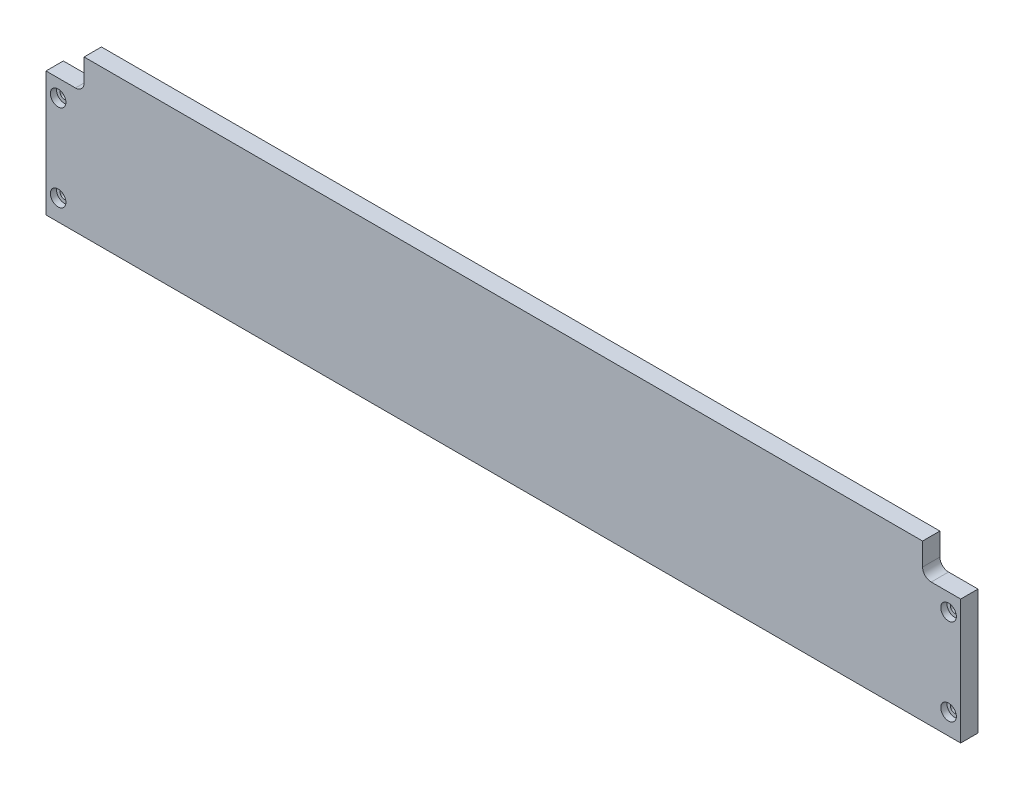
ISO-10303-21;
HEADER;
FILE_DESCRIPTION(('STEP AP214'),'2;1');
FILE_NAME('part.step','',(''),(''),'','','');
FILE_SCHEMA(('AUTOMOTIVE_DESIGN { 1 0 10303 214 1 1 1 1 }'));
ENDSEC;
DATA;
#1=APPLICATION_CONTEXT('core data for automotive mechanical design processes');
#2=APPLICATION_PROTOCOL_DEFINITION('international standard','automotive_design',2000,#1);
#3=PRODUCT_CONTEXT('',#1,'mechanical');
#4=PRODUCT('Part','Part','',(#3));
#5=PRODUCT_RELATED_PRODUCT_CATEGORY('part','',(#4));
#6=PRODUCT_DEFINITION_FORMATION('','',#4);
#7=PRODUCT_DEFINITION_CONTEXT('part definition',#1,'design');
#8=PRODUCT_DEFINITION('design','',#6,#7);
#9=PRODUCT_DEFINITION_SHAPE('','',#8);
#10=(LENGTH_UNIT() NAMED_UNIT(*) SI_UNIT(.MILLI.,.METRE.));
#11=(NAMED_UNIT(*) PLANE_ANGLE_UNIT() SI_UNIT($,.RADIAN.));
#12=(NAMED_UNIT(*) SI_UNIT($,.STERADIAN.) SOLID_ANGLE_UNIT());
#13=UNCERTAINTY_MEASURE_WITH_UNIT(LENGTH_MEASURE(1.E-05),#10,'distance_accuracy_value','');
#14=(GEOMETRIC_REPRESENTATION_CONTEXT(3) GLOBAL_UNCERTAINTY_ASSIGNED_CONTEXT((#13)) GLOBAL_UNIT_ASSIGNED_CONTEXT((#10,
#11,#12)) REPRESENTATION_CONTEXT('',''));
#15=CARTESIAN_POINT('',(0.,0.,0.));
#16=DIRECTION('',(0.,0.,1.));
#17=DIRECTION('',(1.,0.,0.));
#18=AXIS2_PLACEMENT_3D('',#15,#16,#17);
#19=CARTESIAN_POINT('',(-335.28,0.,6.35));
#20=DIRECTION('',(1.,0.,0.));
#21=DIRECTION('',(0.,0.,-1.));
#22=AXIS2_PLACEMENT_3D('',#19,#20,#21);
#23=PLANE('',#22);
#24=DIRECTION('',(0.,-1.,0.));
#25=VECTOR('',#24,1.);
#26=CARTESIAN_POINT('',(-335.28,0.,-6.35));
#27=LINE('',#26,#25);
#28=CARTESIAN_POINT('',(-335.28,91.44,-6.35));
#29=VERTEX_POINT('',#28);
#30=CARTESIAN_POINT('',(-335.28,0.,-6.35));
#31=VERTEX_POINT('',#30);
#32=EDGE_CURVE('E142',#29,#31,#27,.T.);
#33=ORIENTED_EDGE('',*,*,#32,.T.);
#34=DIRECTION('',(0.,0.,-1.));
#35=VECTOR('',#34,1.);
#36=CARTESIAN_POINT('',(-335.28,0.,6.35));
#37=LINE('',#36,#35);
#38=CARTESIAN_POINT('',(-335.28,0.,6.35));
#39=VERTEX_POINT('',#38);
#40=EDGE_CURVE('E11',#39,#31,#37,.T.);
#41=ORIENTED_EDGE('',*,*,#40,.F.);
#42=DIRECTION('',(0.,-1.,0.));
#43=VECTOR('',#42,1.);
#44=CARTESIAN_POINT('',(-335.28,0.,6.35));
#45=LINE('',#44,#43);
#46=CARTESIAN_POINT('',(-335.28,91.44,6.35));
#47=VERTEX_POINT('',#46);
#48=EDGE_CURVE('E161',#47,#39,#45,.T.);
#49=ORIENTED_EDGE('',*,*,#48,.F.);
#50=DIRECTION('',(0.,0.,-1.));
#51=VECTOR('',#50,1.);
#52=CARTESIAN_POINT('',(-335.28,91.44,6.35));
#53=LINE('',#52,#51);
#54=EDGE_CURVE('E138',#47,#29,#53,.T.);
#55=ORIENTED_EDGE('',*,*,#54,.T.);
#56=EDGE_LOOP('',(#33,#41,#49,#55));
#57=FACE_BOUND('',#56,.T.);
#58=ADVANCED_FACE('F34',(#57),#23,.F.);
#59=CARTESIAN_POINT('',(335.28,2.4980018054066E-13,6.35));
#60=DIRECTION('',(0.,1.,0.));
#61=DIRECTION('',(-1.,0.,0.));
#62=AXIS2_PLACEMENT_3D('',#59,#60,#61);
#63=PLANE('',#62);
#64=DIRECTION('',(1.,0.,0.));
#65=VECTOR('',#64,1.);
#66=CARTESIAN_POINT('',(335.28,2.4980018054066E-13,-6.35));
#67=LINE('',#66,#65);
#68=CARTESIAN_POINT('',(335.28,2.4980018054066E-13,-6.35));
#69=VERTEX_POINT('',#68);
#70=EDGE_CURVE('E145',#31,#69,#67,.T.);
#71=ORIENTED_EDGE('',*,*,#70,.T.);
#72=DIRECTION('',(0.,0.,-1.));
#73=VECTOR('',#72,1.);
#74=CARTESIAN_POINT('',(335.28,2.4980018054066E-13,6.35));
#75=LINE('',#74,#73);
#76=CARTESIAN_POINT('',(335.28,2.4980018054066E-13,6.35));
#77=VERTEX_POINT('',#76);
#78=EDGE_CURVE('E42',#77,#69,#75,.T.);
#79=ORIENTED_EDGE('',*,*,#78,.F.);
#80=DIRECTION('',(1.,0.,0.));
#81=VECTOR('',#80,1.);
#82=CARTESIAN_POINT('',(335.28,2.4980018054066E-13,6.35));
#83=LINE('',#82,#81);
#84=EDGE_CURVE('E99',#39,#77,#83,.T.);
#85=ORIENTED_EDGE('',*,*,#84,.F.);
#86=ORIENTED_EDGE('',*,*,#40,.T.);
#87=EDGE_LOOP('',(#71,#79,#85,#86));
#88=FACE_BOUND('',#87,.T.);
#89=ADVANCED_FACE('F292',(#88),#63,.F.);
#90=CARTESIAN_POINT('',(335.28,2.4980018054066E-13,6.35));
#91=DIRECTION('',(-1.,0.,0.));
#92=DIRECTION('',(0.,0.,1.));
#93=AXIS2_PLACEMENT_3D('',#90,#91,#92);
#94=PLANE('',#93);
#95=DIRECTION('',(0.,1.,0.));
#96=VECTOR('',#95,1.);
#97=CARTESIAN_POINT('',(335.28,2.4980018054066E-13,-6.35));
#98=LINE('',#97,#96);
#99=CARTESIAN_POINT('',(335.28,91.44,-6.35));
#100=VERTEX_POINT('',#99);
#101=EDGE_CURVE('E148',#69,#100,#98,.T.);
#102=ORIENTED_EDGE('',*,*,#101,.T.);
#103=DIRECTION('',(0.,0.,-1.));
#104=VECTOR('',#103,1.);
#105=CARTESIAN_POINT('',(335.28,91.44,6.35));
#106=LINE('',#105,#104);
#107=CARTESIAN_POINT('',(335.28,91.44,6.35));
#108=VERTEX_POINT('',#107);
#109=EDGE_CURVE('E174',#108,#100,#106,.T.);
#110=ORIENTED_EDGE('',*,*,#109,.F.);
#111=DIRECTION('',(0.,1.,0.));
#112=VECTOR('',#111,1.);
#113=CARTESIAN_POINT('',(335.28,2.4980018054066E-13,6.35));
#114=LINE('',#113,#112);
#115=EDGE_CURVE('E182',#77,#108,#114,.T.);
#116=ORIENTED_EDGE('',*,*,#115,.F.);
#117=ORIENTED_EDGE('',*,*,#78,.T.);
#118=EDGE_LOOP('',(#102,#110,#116,#117));
#119=FACE_BOUND('',#118,.T.);
#120=ADVANCED_FACE('F180',(#119),#94,.F.);
#121=CARTESIAN_POINT('',(335.28,91.44,6.35));
#122=DIRECTION('',(0.,-1.,0.));
#123=DIRECTION('',(1.,0.,0.));
#124=AXIS2_PLACEMENT_3D('',#121,#122,#123);
#125=PLANE('',#124);
#126=DIRECTION('',(-1.,0.,0.));
#127=VECTOR('',#126,1.);
#128=CARTESIAN_POINT('',(335.28,91.44,-6.35));
#129=LINE('',#128,#127);
#130=CARTESIAN_POINT('',(313.69,91.4399999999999,-6.35));
#131=VERTEX_POINT('',#130);
#132=EDGE_CURVE('E150',#100,#131,#129,.T.);
#133=ORIENTED_EDGE('',*,*,#132,.T.);
#134=DIRECTION('',(0.,0.,-1.));
#135=VECTOR('',#134,1.);
#136=CARTESIAN_POINT('',(313.69,91.4399999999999,6.35));
#137=LINE('',#136,#135);
#138=CARTESIAN_POINT('',(313.69,91.4399999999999,6.35));
#139=VERTEX_POINT('',#138);
#140=EDGE_CURVE('E171',#139,#131,#137,.T.);
#141=ORIENTED_EDGE('',*,*,#140,.F.);
#142=DIRECTION('',(-1.,0.,0.));
#143=VECTOR('',#142,1.);
#144=CARTESIAN_POINT('',(335.28,91.44,6.35));
#145=LINE('',#144,#143);
#146=EDGE_CURVE('E200',#108,#139,#145,.T.);
#147=ORIENTED_EDGE('',*,*,#146,.F.);
#148=ORIENTED_EDGE('',*,*,#109,.T.);
#149=EDGE_LOOP('',(#133,#141,#147,#148));
#150=FACE_BOUND('',#149,.T.);
#151=ADVANCED_FACE('F191',(#150),#125,.F.);
#152=CARTESIAN_POINT('',(313.69,97.7899999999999,6.35));
#153=DIRECTION('',(0.,0.,-1.));
#154=DIRECTION('',(-1.,0.,0.));
#155=AXIS2_PLACEMENT_3D('',#152,#153,#154);
#156=CYLINDRICAL_SURFACE('',#155,6.35000000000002);
#157=CARTESIAN_POINT('',(313.69,97.7899999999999,-6.35));
#158=DIRECTION('',(0.,0.,-1.));
#159=DIRECTION('',(-1.,0.,0.));
#160=AXIS2_PLACEMENT_3D('',#157,#158,#159);
#161=CIRCLE('',#160,6.35000000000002);
#162=CARTESIAN_POINT('',(307.34,97.7899999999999,-6.35));
#163=VERTEX_POINT('',#162);
#164=EDGE_CURVE('E152',#131,#163,#161,.T.);
#165=ORIENTED_EDGE('',*,*,#164,.T.);
#166=DIRECTION('',(0.,0.,-1.));
#167=VECTOR('',#166,1.);
#168=CARTESIAN_POINT('',(307.34,97.7899999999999,6.35));
#169=LINE('',#168,#167);
#170=CARTESIAN_POINT('',(307.34,97.7899999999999,6.35));
#171=VERTEX_POINT('',#170);
#172=EDGE_CURVE('E168',#171,#163,#169,.T.);
#173=ORIENTED_EDGE('',*,*,#172,.F.);
#174=CARTESIAN_POINT('',(313.69,97.7899999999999,6.35));
#175=DIRECTION('',(0.,0.,-1.));
#176=DIRECTION('',(-1.,0.,0.));
#177=AXIS2_PLACEMENT_3D('',#174,#175,#176);
#178=CIRCLE('',#177,6.35000000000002);
#179=EDGE_CURVE('E197',#139,#171,#178,.T.);
#180=ORIENTED_EDGE('',*,*,#179,.F.);
#181=ORIENTED_EDGE('',*,*,#140,.T.);
#182=EDGE_LOOP('',(#165,#173,#180,#181));
#183=FACE_BOUND('',#182,.T.);
#184=ADVANCED_FACE('F195',(#183),#156,.F.);
#185=CARTESIAN_POINT('',(307.34,97.7899999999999,6.35));
#186=DIRECTION('',(-1.,0.,0.));
#187=DIRECTION('',(0.,0.,1.));
#188=AXIS2_PLACEMENT_3D('',#185,#186,#187);
#189=PLANE('',#188);
#190=DIRECTION('',(0.,1.,0.));
#191=VECTOR('',#190,1.);
#192=CARTESIAN_POINT('',(307.34,97.7899999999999,-6.35));
#193=LINE('',#192,#191);
#194=CARTESIAN_POINT('',(307.34,114.3,-6.35));
#195=VERTEX_POINT('',#194);
#196=EDGE_CURVE('E154',#163,#195,#193,.T.);
#197=ORIENTED_EDGE('',*,*,#196,.T.);
#198=DIRECTION('',(0.,0.,-1.));
#199=VECTOR('',#198,1.);
#200=CARTESIAN_POINT('',(307.34,114.3,6.35));
#201=LINE('',#200,#199);
#202=CARTESIAN_POINT('',(307.34,114.3,6.35));
#203=VERTEX_POINT('',#202);
#204=EDGE_CURVE('E165',#203,#195,#201,.T.);
#205=ORIENTED_EDGE('',*,*,#204,.F.);
#206=DIRECTION('',(0.,1.,0.));
#207=VECTOR('',#206,1.);
#208=CARTESIAN_POINT('',(307.34,97.7899999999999,6.35));
#209=LINE('',#208,#207);
#210=EDGE_CURVE('E199',#171,#203,#209,.T.);
#211=ORIENTED_EDGE('',*,*,#210,.F.);
#212=ORIENTED_EDGE('',*,*,#172,.T.);
#213=EDGE_LOOP('',(#197,#205,#211,#212));
#214=FACE_BOUND('',#213,.T.);
#215=ADVANCED_FACE('F304',(#214),#189,.F.);
#216=CARTESIAN_POINT('',(-307.34,114.3,6.35));
#217=DIRECTION('',(0.,-1.,0.));
#218=DIRECTION('',(0.,0.,-1.));
#219=AXIS2_PLACEMENT_3D('',#216,#217,#218);
#220=PLANE('',#219);
#221=DIRECTION('',(-1.,0.,0.));
#222=VECTOR('',#221,1.);
#223=CARTESIAN_POINT('',(-307.34,114.3,-6.35));
#224=LINE('',#223,#222);
#225=CARTESIAN_POINT('',(-307.34,114.3,-6.35));
#226=VERTEX_POINT('',#225);
#227=EDGE_CURVE('E156',#195,#226,#224,.T.);
#228=ORIENTED_EDGE('',*,*,#227,.T.);
#229=DIRECTION('',(0.,0.,-1.));
#230=VECTOR('',#229,1.);
#231=CARTESIAN_POINT('',(-307.34,114.3,6.35));
#232=LINE('',#231,#230);
#233=CARTESIAN_POINT('',(-307.34,114.3,6.35));
#234=VERTEX_POINT('',#233);
#235=EDGE_CURVE('E133',#234,#226,#232,.T.);
#236=ORIENTED_EDGE('',*,*,#235,.F.);
#237=DIRECTION('',(-1.,0.,0.));
#238=VECTOR('',#237,1.);
#239=CARTESIAN_POINT('',(-307.34,114.3,6.35));
#240=LINE('',#239,#238);
#241=EDGE_CURVE('E124',#203,#234,#240,.T.);
#242=ORIENTED_EDGE('',*,*,#241,.F.);
#243=ORIENTED_EDGE('',*,*,#204,.T.);
#244=EDGE_LOOP('',(#228,#236,#242,#243));
#245=FACE_BOUND('',#244,.T.);
#246=ADVANCED_FACE('F301',(#245),#220,.F.);
#247=CARTESIAN_POINT('',(-307.34,97.7899999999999,6.35));
#248=DIRECTION('',(1.,0.,0.));
#249=DIRECTION('',(0.,0.,-1.));
#250=AXIS2_PLACEMENT_3D('',#247,#248,#249);
#251=PLANE('',#250);
#252=DIRECTION('',(0.,-1.,0.));
#253=VECTOR('',#252,1.);
#254=CARTESIAN_POINT('',(-307.34,97.7899999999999,-6.35));
#255=LINE('',#254,#253);
#256=CARTESIAN_POINT('',(-307.34,97.7899999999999,-6.35));
#257=VERTEX_POINT('',#256);
#258=EDGE_CURVE('E132',#226,#257,#255,.T.);
#259=ORIENTED_EDGE('',*,*,#258,.T.);
#260=DIRECTION('',(0.,0.,-1.));
#261=VECTOR('',#260,1.);
#262=CARTESIAN_POINT('',(-307.34,97.7899999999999,6.35));
#263=LINE('',#262,#261);
#264=CARTESIAN_POINT('',(-307.34,97.7899999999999,6.35));
#265=VERTEX_POINT('',#264);
#266=EDGE_CURVE('E129',#265,#257,#263,.T.);
#267=ORIENTED_EDGE('',*,*,#266,.F.);
#268=DIRECTION('',(0.,-1.,0.));
#269=VECTOR('',#268,1.);
#270=CARTESIAN_POINT('',(-307.34,97.7899999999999,6.35));
#271=LINE('',#270,#269);
#272=EDGE_CURVE('E118',#234,#265,#271,.T.);
#273=ORIENTED_EDGE('',*,*,#272,.F.);
#274=ORIENTED_EDGE('',*,*,#235,.T.);
#275=EDGE_LOOP('',(#259,#267,#273,#274));
#276=FACE_BOUND('',#275,.T.);
#277=ADVANCED_FACE('F130',(#276),#251,.F.);
#278=CARTESIAN_POINT('',(-313.69,97.7899999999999,6.35));
#279=DIRECTION('',(0.,0.,-1.));
#280=DIRECTION('',(-1.,0.,0.));
#281=AXIS2_PLACEMENT_3D('',#278,#279,#280);
#282=CYLINDRICAL_SURFACE('',#281,6.35000000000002);
#283=CARTESIAN_POINT('',(-313.69,97.7899999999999,-6.35));
#284=DIRECTION('',(0.,0.,-1.));
#285=DIRECTION('',(1.,0.,0.));
#286=AXIS2_PLACEMENT_3D('',#283,#284,#285);
#287=CIRCLE('',#286,6.35000000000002);
#288=CARTESIAN_POINT('',(-313.69,91.4399999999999,-6.35));
#289=VERTEX_POINT('',#288);
#290=EDGE_CURVE('E85',#257,#289,#287,.T.);
#291=ORIENTED_EDGE('',*,*,#290,.T.);
#292=DIRECTION('',(0.,0.,-1.));
#293=VECTOR('',#292,1.);
#294=CARTESIAN_POINT('',(-313.69,91.4399999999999,6.35));
#295=LINE('',#294,#293);
#296=CARTESIAN_POINT('',(-313.69,91.4399999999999,6.35));
#297=VERTEX_POINT('',#296);
#298=EDGE_CURVE('E134',#297,#289,#295,.T.);
#299=ORIENTED_EDGE('',*,*,#298,.F.);
#300=CARTESIAN_POINT('',(-313.69,97.7899999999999,6.35));
#301=DIRECTION('',(0.,0.,-1.));
#302=DIRECTION('',(1.,0.,0.));
#303=AXIS2_PLACEMENT_3D('',#300,#301,#302);
#304=CIRCLE('',#303,6.35000000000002);
#305=EDGE_CURVE('E122',#265,#297,#304,.T.);
#306=ORIENTED_EDGE('',*,*,#305,.F.);
#307=ORIENTED_EDGE('',*,*,#266,.T.);
#308=EDGE_LOOP('',(#291,#299,#306,#307));
#309=FACE_BOUND('',#308,.T.);
#310=ADVANCED_FACE('F136',(#309),#282,.F.);
#311=CARTESIAN_POINT('',(-335.28,91.44,6.35));
#312=DIRECTION('',(0.,-1.,0.));
#313=DIRECTION('',(1.,0.,0.));
#314=AXIS2_PLACEMENT_3D('',#311,#312,#313);
#315=PLANE('',#314);
#316=DIRECTION('',(-1.,0.,0.));
#317=VECTOR('',#316,1.);
#318=CARTESIAN_POINT('',(-335.28,91.44,-6.35));
#319=LINE('',#318,#317);
#320=EDGE_CURVE('E91',#289,#29,#319,.T.);
#321=ORIENTED_EDGE('',*,*,#320,.T.);
#322=ORIENTED_EDGE('',*,*,#54,.F.);
#323=DIRECTION('',(-1.,0.,0.));
#324=VECTOR('',#323,1.);
#325=CARTESIAN_POINT('',(-335.28,91.44,6.35));
#326=LINE('',#325,#324);
#327=EDGE_CURVE('E50',#297,#47,#326,.T.);
#328=ORIENTED_EDGE('',*,*,#327,.F.);
#329=ORIENTED_EDGE('',*,*,#298,.T.);
#330=EDGE_LOOP('',(#321,#322,#328,#329));
#331=FACE_BOUND('',#330,.T.);
#332=ADVANCED_FACE('F356',(#331),#315,.F.);
#333=CARTESIAN_POINT('',(-313.69,97.7899999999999,6.35));
#334=DIRECTION('',(0.,0.,1.));
#335=DIRECTION('',(1.,0.,0.));
#336=AXIS2_PLACEMENT_3D('',#333,#334,#335);
#337=PLANE('',#336);
#338=CARTESIAN_POINT('',(-326.39,15.24,6.35));
#339=DIRECTION('',(0.,0.,-1.));
#340=DIRECTION('',(-1.,0.,0.));
#341=AXIS2_PLACEMENT_3D('',#338,#339,#340);
#342=CIRCLE('',#341,5.71500000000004);
#343=CARTESIAN_POINT('',(-332.105,15.24,6.35));
#344=VERTEX_POINT('',#343);
#345=EDGE_CURVE('E238',#344,#344,#342,.T.);
#346=ORIENTED_EDGE('',*,*,#345,.T.);
#347=EDGE_LOOP('',(#346));
#348=FACE_BOUND('',#347,.T.);
#349=CARTESIAN_POINT('',(-326.39,78.74,6.35));
#350=DIRECTION('',(0.,0.,-1.));
#351=DIRECTION('',(-1.,0.,0.));
#352=AXIS2_PLACEMENT_3D('',#349,#350,#351);
#353=CIRCLE('',#352,5.71500000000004);
#354=CARTESIAN_POINT('',(-332.105,78.74,6.35));
#355=VERTEX_POINT('',#354);
#356=EDGE_CURVE('E232',#355,#355,#353,.T.);
#357=ORIENTED_EDGE('',*,*,#356,.T.);
#358=EDGE_LOOP('',(#357));
#359=FACE_BOUND('',#358,.T.);
#360=CARTESIAN_POINT('',(326.39,15.24,6.35));
#361=DIRECTION('',(0.,0.,1.));
#362=DIRECTION('',(1.,0.,0.));
#363=AXIS2_PLACEMENT_3D('',#360,#361,#362);
#364=CIRCLE('',#363,5.71500000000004);
#365=CARTESIAN_POINT('',(332.105,15.24,6.35));
#366=VERTEX_POINT('',#365);
#367=EDGE_CURVE('E220',#366,#366,#364,.T.);
#368=ORIENTED_EDGE('',*,*,#367,.F.);
#369=EDGE_LOOP('',(#368));
#370=FACE_BOUND('',#369,.T.);
#371=CARTESIAN_POINT('',(326.39,78.74,6.35));
#372=DIRECTION('',(0.,0.,1.));
#373=DIRECTION('',(1.,0.,0.));
#374=AXIS2_PLACEMENT_3D('',#371,#372,#373);
#375=CIRCLE('',#374,5.71500000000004);
#376=CARTESIAN_POINT('',(332.105,78.74,6.35));
#377=VERTEX_POINT('',#376);
#378=EDGE_CURVE('E208',#377,#377,#375,.T.);
#379=ORIENTED_EDGE('',*,*,#378,.F.);
#380=EDGE_LOOP('',(#379));
#381=FACE_BOUND('',#380,.T.);
#382=ORIENTED_EDGE('',*,*,#48,.T.);
#383=ORIENTED_EDGE('',*,*,#84,.T.);
#384=ORIENTED_EDGE('',*,*,#115,.T.);
#385=ORIENTED_EDGE('',*,*,#146,.T.);
#386=ORIENTED_EDGE('',*,*,#179,.T.);
#387=ORIENTED_EDGE('',*,*,#210,.T.);
#388=ORIENTED_EDGE('',*,*,#241,.T.);
#389=ORIENTED_EDGE('',*,*,#272,.T.);
#390=ORIENTED_EDGE('',*,*,#305,.T.);
#391=ORIENTED_EDGE('',*,*,#327,.T.);
#392=EDGE_LOOP('',(#382,#383,#384,#385,#386,#387,#388,#389,#390,#391));
#393=FACE_BOUND('',#392,.T.);
#394=ADVANCED_FACE('F120',(#348,#359,#370,#381,#393),#337,.T.);
#395=CARTESIAN_POINT('',(-313.69,97.7899999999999,-6.35));
#396=DIRECTION('',(0.,0.,1.));
#397=DIRECTION('',(1.,0.,0.));
#398=AXIS2_PLACEMENT_3D('',#395,#396,#397);
#399=PLANE('',#398);
#400=CARTESIAN_POINT('',(-326.39,15.24,-6.35));
#401=DIRECTION('',(0.,0.,1.));
#402=DIRECTION('',(1.,0.,0.));
#403=AXIS2_PLACEMENT_3D('',#400,#401,#402);
#404=CIRCLE('',#403,3.17499999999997);
#405=CARTESIAN_POINT('',(-323.215,15.24,-6.35));
#406=VERTEX_POINT('',#405);
#407=EDGE_CURVE('E249',#406,#406,#404,.F.);
#408=ORIENTED_EDGE('',*,*,#407,.F.);
#409=EDGE_LOOP('',(#408));
#410=FACE_BOUND('',#409,.T.);
#411=CARTESIAN_POINT('',(-326.39,78.74,-6.35));
#412=DIRECTION('',(0.,0.,1.));
#413=DIRECTION('',(1.,0.,0.));
#414=AXIS2_PLACEMENT_3D('',#411,#412,#413);
#415=CIRCLE('',#414,3.17499999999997);
#416=CARTESIAN_POINT('',(-323.215,78.74,-6.35));
#417=VERTEX_POINT('',#416);
#418=EDGE_CURVE('E241',#417,#417,#415,.F.);
#419=ORIENTED_EDGE('',*,*,#418,.F.);
#420=EDGE_LOOP('',(#419));
#421=FACE_BOUND('',#420,.T.);
#422=CARTESIAN_POINT('',(326.39,15.24,-6.35));
#423=DIRECTION('',(0.,0.,1.));
#424=DIRECTION('',(1.,0.,0.));
#425=AXIS2_PLACEMENT_3D('',#422,#423,#424);
#426=CIRCLE('',#425,3.17499999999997);
#427=CARTESIAN_POINT('',(329.565,15.24,-6.35));
#428=VERTEX_POINT('',#427);
#429=EDGE_CURVE('E223',#428,#428,#426,.T.);
#430=ORIENTED_EDGE('',*,*,#429,.T.);
#431=EDGE_LOOP('',(#430));
#432=FACE_BOUND('',#431,.T.);
#433=CARTESIAN_POINT('',(326.39,78.74,-6.35));
#434=DIRECTION('',(0.,0.,1.));
#435=DIRECTION('',(1.,0.,0.));
#436=AXIS2_PLACEMENT_3D('',#433,#434,#435);
#437=CIRCLE('',#436,3.17499999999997);
#438=CARTESIAN_POINT('',(329.565,78.74,-6.35));
#439=VERTEX_POINT('',#438);
#440=EDGE_CURVE('E211',#439,#439,#437,.T.);
#441=ORIENTED_EDGE('',*,*,#440,.T.);
#442=EDGE_LOOP('',(#441));
#443=FACE_BOUND('',#442,.T.);
#444=ORIENTED_EDGE('',*,*,#32,.F.);
#445=ORIENTED_EDGE('',*,*,#320,.F.);
#446=ORIENTED_EDGE('',*,*,#290,.F.);
#447=ORIENTED_EDGE('',*,*,#258,.F.);
#448=ORIENTED_EDGE('',*,*,#227,.F.);
#449=ORIENTED_EDGE('',*,*,#196,.F.);
#450=ORIENTED_EDGE('',*,*,#164,.F.);
#451=ORIENTED_EDGE('',*,*,#132,.F.);
#452=ORIENTED_EDGE('',*,*,#101,.F.);
#453=ORIENTED_EDGE('',*,*,#70,.F.);
#454=EDGE_LOOP('',(#444,#445,#446,#447,#448,#449,#450,#451,#452,#453));
#455=FACE_BOUND('',#454,.T.);
#456=ADVANCED_FACE('F186',(#410,#421,#432,#443,#455),#399,.F.);
#457=CARTESIAN_POINT('',(326.39,78.74,1.778));
#458=DIRECTION('',(0.,0.,1.));
#459=DIRECTION('',(1.,0.,0.));
#460=AXIS2_PLACEMENT_3D('',#457,#458,#459);
#461=CYLINDRICAL_SURFACE('',#460,5.71500000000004);
#462=CARTESIAN_POINT('',(326.39,78.74,1.778));
#463=DIRECTION('',(0.,0.,1.));
#464=DIRECTION('',(1.,0.,0.));
#465=AXIS2_PLACEMENT_3D('',#462,#463,#464);
#466=CIRCLE('',#465,5.71500000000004);
#467=CARTESIAN_POINT('',(332.105,78.74,1.778));
#468=VERTEX_POINT('',#467);
#469=EDGE_CURVE('E146',#468,#468,#466,.T.);
#470=ORIENTED_EDGE('',*,*,#469,.F.);
#471=EDGE_LOOP('',(#470));
#472=FACE_BOUND('',#471,.T.);
#473=ORIENTED_EDGE('',*,*,#378,.T.);
#474=EDGE_LOOP('',(#473));
#475=FACE_BOUND('',#474,.T.);
#476=ADVANCED_FACE('F268',(#472,#475),#461,.F.);
#477=CARTESIAN_POINT('',(326.39,78.74,1.778));
#478=DIRECTION('',(0.,0.,1.));
#479=DIRECTION('',(1.,0.,0.));
#480=AXIS2_PLACEMENT_3D('',#477,#478,#479);
#481=PLANE('',#480);
#482=CARTESIAN_POINT('',(326.39,78.74,1.778));
#483=DIRECTION('',(0.,0.,1.));
#484=DIRECTION('',(1.,0.,0.));
#485=AXIS2_PLACEMENT_3D('',#482,#483,#484);
#486=CIRCLE('',#485,3.17499999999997);
#487=CARTESIAN_POINT('',(329.565,78.74,1.778));
#488=VERTEX_POINT('',#487);
#489=EDGE_CURVE('E216',#488,#488,#486,.T.);
#490=ORIENTED_EDGE('',*,*,#489,.F.);
#491=EDGE_LOOP('',(#490));
#492=FACE_BOUND('',#491,.T.);
#493=ORIENTED_EDGE('',*,*,#469,.T.);
#494=EDGE_LOOP('',(#493));
#495=FACE_BOUND('',#494,.T.);
#496=ADVANCED_FACE('F279',(#492,#495),#481,.T.);
#497=CARTESIAN_POINT('',(326.39,78.74,-9.652));
#498=DIRECTION('',(0.,0.,1.));
#499=DIRECTION('',(1.,0.,0.));
#500=AXIS2_PLACEMENT_3D('',#497,#498,#499);
#501=CYLINDRICAL_SURFACE('',#500,3.17499999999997);
#502=ORIENTED_EDGE('',*,*,#489,.T.);
#503=EDGE_LOOP('',(#502));
#504=FACE_BOUND('',#503,.T.);
#505=ORIENTED_EDGE('',*,*,#440,.F.);
#506=EDGE_LOOP('',(#505));
#507=FACE_BOUND('',#506,.T.);
#508=ADVANCED_FACE('F276',(#504,#507),#501,.F.);
#509=CARTESIAN_POINT('',(326.39,15.24,1.778));
#510=DIRECTION('',(0.,0.,1.));
#511=DIRECTION('',(1.,0.,0.));
#512=AXIS2_PLACEMENT_3D('',#509,#510,#511);
#513=CYLINDRICAL_SURFACE('',#512,5.71500000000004);
#514=CARTESIAN_POINT('',(326.39,15.24,1.778));
#515=DIRECTION('',(0.,0.,1.));
#516=DIRECTION('',(1.,0.,0.));
#517=AXIS2_PLACEMENT_3D('',#514,#515,#516);
#518=CIRCLE('',#517,5.71500000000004);
#519=CARTESIAN_POINT('',(332.105,15.24,1.778));
#520=VERTEX_POINT('',#519);
#521=EDGE_CURVE('E219',#520,#520,#518,.T.);
#522=ORIENTED_EDGE('',*,*,#521,.F.);
#523=EDGE_LOOP('',(#522));
#524=FACE_BOUND('',#523,.T.);
#525=ORIENTED_EDGE('',*,*,#367,.T.);
#526=EDGE_LOOP('',(#525));
#527=FACE_BOUND('',#526,.T.);
#528=ADVANCED_FACE('F278',(#524,#527),#513,.F.);
#529=CARTESIAN_POINT('',(326.39,15.24,1.778));
#530=DIRECTION('',(0.,0.,1.));
#531=DIRECTION('',(1.,0.,0.));
#532=AXIS2_PLACEMENT_3D('',#529,#530,#531);
#533=PLANE('',#532);
#534=CARTESIAN_POINT('',(326.39,15.24,1.778));
#535=DIRECTION('',(0.,0.,1.));
#536=DIRECTION('',(1.,0.,0.));
#537=AXIS2_PLACEMENT_3D('',#534,#535,#536);
#538=CIRCLE('',#537,3.17499999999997);
#539=CARTESIAN_POINT('',(329.565,15.24,1.778));
#540=VERTEX_POINT('',#539);
#541=EDGE_CURVE('E228',#540,#540,#538,.T.);
#542=ORIENTED_EDGE('',*,*,#541,.F.);
#543=EDGE_LOOP('',(#542));
#544=FACE_BOUND('',#543,.T.);
#545=ORIENTED_EDGE('',*,*,#521,.T.);
#546=EDGE_LOOP('',(#545));
#547=FACE_BOUND('',#546,.T.);
#548=ADVANCED_FACE('F286',(#544,#547),#533,.T.);
#549=CARTESIAN_POINT('',(326.39,15.24,-9.652));
#550=DIRECTION('',(0.,0.,1.));
#551=DIRECTION('',(1.,0.,0.));
#552=AXIS2_PLACEMENT_3D('',#549,#550,#551);
#553=CYLINDRICAL_SURFACE('',#552,3.17499999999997);
#554=ORIENTED_EDGE('',*,*,#541,.T.);
#555=EDGE_LOOP('',(#554));
#556=FACE_BOUND('',#555,.T.);
#557=ORIENTED_EDGE('',*,*,#429,.F.);
#558=EDGE_LOOP('',(#557));
#559=FACE_BOUND('',#558,.T.);
#560=ADVANCED_FACE('F401',(#556,#559),#553,.F.);
#561=CARTESIAN_POINT('',(-326.39,78.74,1.778));
#562=DIRECTION('',(0.,0.,1.));
#563=DIRECTION('',(1.,0.,0.));
#564=AXIS2_PLACEMENT_3D('',#561,#562,#563);
#565=CYLINDRICAL_SURFACE('',#564,5.71500000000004);
#566=CARTESIAN_POINT('',(-326.39,78.74,1.778));
#567=DIRECTION('',(0.,0.,-1.));
#568=DIRECTION('',(-1.,0.,0.));
#569=AXIS2_PLACEMENT_3D('',#566,#567,#568);
#570=CIRCLE('',#569,5.71500000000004);
#571=CARTESIAN_POINT('',(-332.105,78.74,1.778));
#572=VERTEX_POINT('',#571);
#573=EDGE_CURVE('E231',#572,#572,#570,.T.);
#574=ORIENTED_EDGE('',*,*,#573,.T.);
#575=EDGE_LOOP('',(#574));
#576=FACE_BOUND('',#575,.T.);
#577=ORIENTED_EDGE('',*,*,#356,.F.);
#578=EDGE_LOOP('',(#577));
#579=FACE_BOUND('',#578,.T.);
#580=ADVANCED_FACE('F411',(#576,#579),#565,.F.);
#581=CARTESIAN_POINT('',(-326.39,78.74,1.778));
#582=DIRECTION('',(0.,0.,1.));
#583=DIRECTION('',(-1.,0.,0.));
#584=AXIS2_PLACEMENT_3D('',#581,#582,#583);
#585=PLANE('',#584);
#586=CARTESIAN_POINT('',(-326.39,78.74,1.778));
#587=DIRECTION('',(0.,0.,-1.));
#588=DIRECTION('',(-1.,0.,0.));
#589=AXIS2_PLACEMENT_3D('',#586,#587,#588);
#590=CIRCLE('',#589,3.17499999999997);
#591=CARTESIAN_POINT('',(-329.565,78.74,1.778));
#592=VERTEX_POINT('',#591);
#593=EDGE_CURVE('E246',#592,#592,#590,.T.);
#594=ORIENTED_EDGE('',*,*,#593,.T.);
#595=EDGE_LOOP('',(#594));
#596=FACE_BOUND('',#595,.T.);
#597=ORIENTED_EDGE('',*,*,#573,.F.);
#598=EDGE_LOOP('',(#597));
#599=FACE_BOUND('',#598,.T.);
#600=ADVANCED_FACE('F433',(#596,#599),#585,.T.);
#601=CARTESIAN_POINT('',(-326.39,15.24,1.778));
#602=DIRECTION('',(0.,0.,1.));
#603=DIRECTION('',(1.,0.,0.));
#604=AXIS2_PLACEMENT_3D('',#601,#602,#603);
#605=CYLINDRICAL_SURFACE('',#604,5.71500000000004);
#606=CARTESIAN_POINT('',(-326.39,15.24,1.778));
#607=DIRECTION('',(0.,0.,-1.));
#608=DIRECTION('',(-1.,0.,0.));
#609=AXIS2_PLACEMENT_3D('',#606,#607,#608);
#610=CIRCLE('',#609,5.71500000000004);
#611=CARTESIAN_POINT('',(-332.105,15.24,1.778));
#612=VERTEX_POINT('',#611);
#613=EDGE_CURVE('E235',#612,#612,#610,.T.);
#614=ORIENTED_EDGE('',*,*,#613,.T.);
#615=EDGE_LOOP('',(#614));
#616=FACE_BOUND('',#615,.T.);
#617=ORIENTED_EDGE('',*,*,#345,.F.);
#618=EDGE_LOOP('',(#617));
#619=FACE_BOUND('',#618,.T.);
#620=ADVANCED_FACE('F443',(#616,#619),#605,.F.);
#621=CARTESIAN_POINT('',(-326.39,15.24,1.778));
#622=DIRECTION('',(0.,0.,1.));
#623=DIRECTION('',(-1.,0.,0.));
#624=AXIS2_PLACEMENT_3D('',#621,#622,#623);
#625=PLANE('',#624);
#626=CARTESIAN_POINT('',(-326.39,15.24,1.778));
#627=DIRECTION('',(0.,0.,-1.));
#628=DIRECTION('',(-1.,0.,0.));
#629=AXIS2_PLACEMENT_3D('',#626,#627,#628);
#630=CIRCLE('',#629,3.17499999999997);
#631=CARTESIAN_POINT('',(-329.565,15.24,1.778));
#632=VERTEX_POINT('',#631);
#633=EDGE_CURVE('E252',#632,#632,#630,.T.);
#634=ORIENTED_EDGE('',*,*,#633,.T.);
#635=EDGE_LOOP('',(#634));
#636=FACE_BOUND('',#635,.T.);
#637=ORIENTED_EDGE('',*,*,#613,.F.);
#638=EDGE_LOOP('',(#637));
#639=FACE_BOUND('',#638,.T.);
#640=ADVANCED_FACE('F256',(#636,#639),#625,.T.);
#641=CARTESIAN_POINT('',(-326.39,78.74,-9.652));
#642=DIRECTION('',(0.,0.,1.));
#643=DIRECTION('',(1.,0.,0.));
#644=AXIS2_PLACEMENT_3D('',#641,#642,#643);
#645=CYLINDRICAL_SURFACE('',#644,3.17499999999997);
#646=ORIENTED_EDGE('',*,*,#593,.F.);
#647=EDGE_LOOP('',(#646));
#648=FACE_BOUND('',#647,.T.);
#649=ORIENTED_EDGE('',*,*,#418,.T.);
#650=EDGE_LOOP('',(#649));
#651=FACE_BOUND('',#650,.T.);
#652=ADVANCED_FACE('F262',(#648,#651),#645,.F.);
#653=CARTESIAN_POINT('',(-326.39,15.24,-9.652));
#654=DIRECTION('',(0.,0.,1.));
#655=DIRECTION('',(1.,0.,0.));
#656=AXIS2_PLACEMENT_3D('',#653,#654,#655);
#657=CYLINDRICAL_SURFACE('',#656,3.17499999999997);
#658=ORIENTED_EDGE('',*,*,#633,.F.);
#659=EDGE_LOOP('',(#658));
#660=FACE_BOUND('',#659,.T.);
#661=ORIENTED_EDGE('',*,*,#407,.T.);
#662=EDGE_LOOP('',(#661));
#663=FACE_BOUND('',#662,.T.);
#664=ADVANCED_FACE('F259',(#660,#663),#657,.F.);
#665=CLOSED_SHELL('',(#58,#89,#120,#151,#184,#215,#246,#277,#310,#332,#394,#456,#476,#496,#508,
#528,#548,#560,#580,#600,#620,#640,#652,#664));
#666=MANIFOLD_SOLID_BREP('B2',#665);
#667=ADVANCED_BREP_SHAPE_REPRESENTATION('',(#18,#666),#14);
#668=SHAPE_DEFINITION_REPRESENTATION(#9,#667);
ENDSEC;
END-ISO-10303-21;
